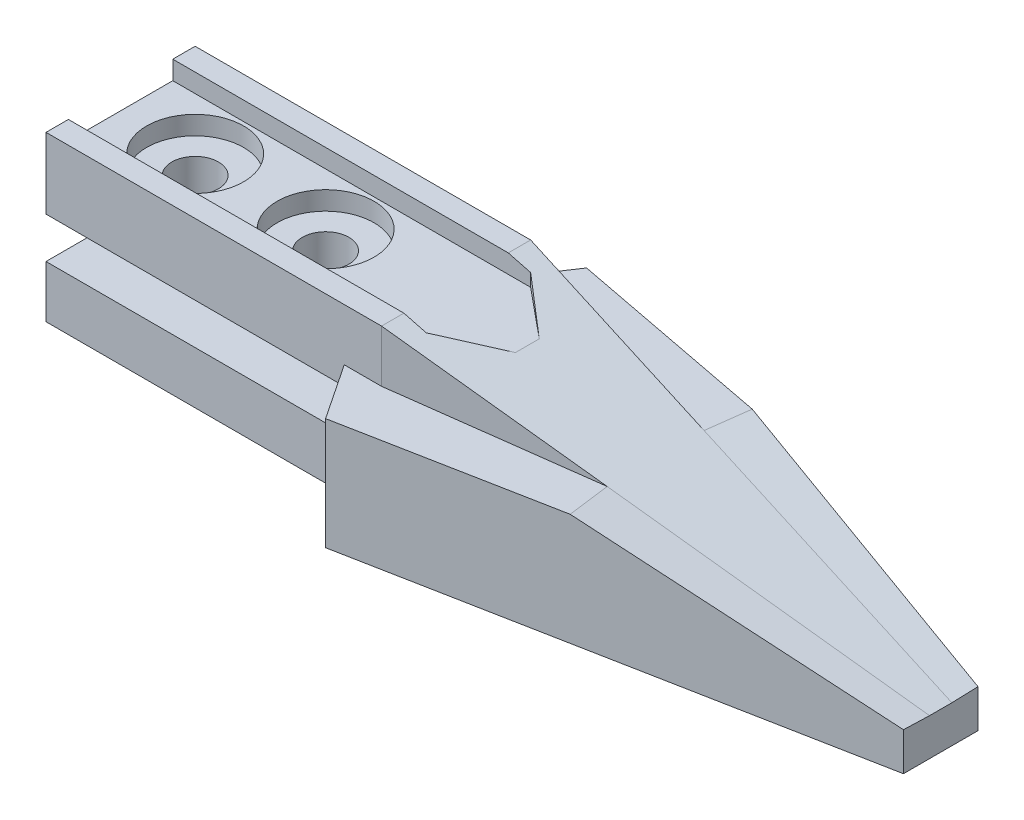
ISO-10303-21;
HEADER;
FILE_DESCRIPTION(('STEP AP214'),'2;1');
FILE_NAME('part.step','',(''),(''),'','','');
FILE_SCHEMA(('AUTOMOTIVE_DESIGN { 1 0 10303 214 1 1 1 1 }'));
ENDSEC;
DATA;
#1=APPLICATION_CONTEXT('core data for automotive mechanical design processes');
#2=APPLICATION_PROTOCOL_DEFINITION('international standard','automotive_design',2000,#1);
#3=PRODUCT_CONTEXT('',#1,'mechanical');
#4=PRODUCT('Part','Part','',(#3));
#5=PRODUCT_RELATED_PRODUCT_CATEGORY('part','',(#4));
#6=PRODUCT_DEFINITION_FORMATION('','',#4);
#7=PRODUCT_DEFINITION_CONTEXT('part definition',#1,'design');
#8=PRODUCT_DEFINITION('design','',#6,#7);
#9=PRODUCT_DEFINITION_SHAPE('','',#8);
#10=(LENGTH_UNIT() NAMED_UNIT(*) SI_UNIT(.MILLI.,.METRE.));
#11=(NAMED_UNIT(*) PLANE_ANGLE_UNIT() SI_UNIT($,.RADIAN.));
#12=(NAMED_UNIT(*) SI_UNIT($,.STERADIAN.) SOLID_ANGLE_UNIT());
#13=UNCERTAINTY_MEASURE_WITH_UNIT(LENGTH_MEASURE(1.E-05),#10,'distance_accuracy_value','');
#14=(GEOMETRIC_REPRESENTATION_CONTEXT(3) GLOBAL_UNCERTAINTY_ASSIGNED_CONTEXT((#13)) GLOBAL_UNIT_ASSIGNED_CONTEXT((#10,
#11,#12)) REPRESENTATION_CONTEXT('',''));
#15=CARTESIAN_POINT('',(0.,0.,0.));
#16=DIRECTION('',(0.,0.,1.));
#17=DIRECTION('',(1.,0.,0.));
#18=AXIS2_PLACEMENT_3D('',#15,#16,#17);
#19=CARTESIAN_POINT('',(220.,-34.,20.));
#20=DIRECTION('',(-1.,0.,0.));
#21=DIRECTION('',(0.,0.,1.));
#22=AXIS2_PLACEMENT_3D('',#19,#20,#21);
#23=PLANE('',#22);
#24=DIRECTION('',(0.,-0.0336071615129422,-0.999435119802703));
#25=VECTOR('',#24,1.);
#26=CARTESIAN_POINT('',(220.,-33.4290009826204,19.9807994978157));
#27=LINE('',#26,#25);
#28=CARTESIAN_POINT('',(220.,-33.7646169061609,10.));
#29=VERTEX_POINT('',#28);
#30=CARTESIAN_POINT('',(220.,-34.,3.00000000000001));
#31=VERTEX_POINT('',#30);
#32=EDGE_CURVE('E192',#29,#31,#27,.T.);
#33=ORIENTED_EDGE('',*,*,#32,.F.);
#34=DIRECTION('',(0.,-1.,0.));
#35=VECTOR('',#34,1.);
#36=CARTESIAN_POINT('',(220.,-14.,10.));
#37=LINE('',#36,#35);
#38=CARTESIAN_POINT('',(220.,-44.,10.));
#39=VERTEX_POINT('',#38);
#40=EDGE_CURVE('E499',#29,#39,#37,.T.);
#41=ORIENTED_EDGE('',*,*,#40,.T.);
#42=DIRECTION('',(0.,0.,-1.));
#43=VECTOR('',#42,1.);
#44=CARTESIAN_POINT('',(220.,-44.,20.));
#45=LINE('',#44,#43);
#46=CARTESIAN_POINT('',(220.,-44.,-10.));
#47=VERTEX_POINT('',#46);
#48=EDGE_CURVE('E218',#39,#47,#45,.T.);
#49=ORIENTED_EDGE('',*,*,#48,.T.);
#50=DIRECTION('',(0.,-1.,0.));
#51=VECTOR('',#50,1.);
#52=CARTESIAN_POINT('',(220.,-14.,-10.));
#53=LINE('',#52,#51);
#54=CARTESIAN_POINT('',(220.,-33.7646169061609,-10.));
#55=VERTEX_POINT('',#54);
#56=EDGE_CURVE('E296',#55,#47,#53,.T.);
#57=ORIENTED_EDGE('',*,*,#56,.F.);
#58=DIRECTION('',(0.,-0.0336071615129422,0.999435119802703));
#59=VECTOR('',#58,1.);
#60=CARTESIAN_POINT('',(220.,-34.772528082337,19.974022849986));
#61=LINE('',#60,#59);
#62=CARTESIAN_POINT('',(220.,-34.,-3.00000000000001));
#63=VERTEX_POINT('',#62);
#64=EDGE_CURVE('E217',#55,#63,#61,.T.);
#65=ORIENTED_EDGE('',*,*,#64,.T.);
#66=DIRECTION('',(0.,0.,-1.));
#67=VECTOR('',#66,1.);
#68=CARTESIAN_POINT('',(220.,-34.,20.));
#69=LINE('',#68,#67);
#70=EDGE_CURVE('E210',#31,#63,#69,.T.);
#71=ORIENTED_EDGE('',*,*,#70,.F.);
#72=EDGE_LOOP('',(#33,#41,#49,#57,#65,#71));
#73=FACE_BOUND('',#72,.T.);
#74=ADVANCED_FACE('F39',(#73),#23,.F.);
#75=CARTESIAN_POINT('',(90.,-14.,35.));
#76=DIRECTION('',(-0.188847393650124,0.,-0.982006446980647));
#77=DIRECTION('',(-0.982006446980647,0.,0.188847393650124));
#78=AXIS2_PLACEMENT_3D('',#75,#76,#77);
#79=PLANE('',#78);
#80=DIRECTION('',(0.950670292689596,-0.250604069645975,-0.182821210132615));
#81=VECTOR('',#80,1.);
#82=CARTESIAN_POINT('',(93.4555531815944,-0.406518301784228,34.3354705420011));
#83=LINE('',#82,#81);
#84=CARTESIAN_POINT('',(145.022629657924,-14.,24.4187250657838));
#85=VERTEX_POINT('',#84);
#86=EDGE_CURVE('E198',#85,#29,#83,.T.);
#87=ORIENTED_EDGE('',*,*,#86,.F.);
#88=DIRECTION('',(0.982006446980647,0.,-0.188847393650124));
#89=VECTOR('',#88,1.);
#90=CARTESIAN_POINT('',(90.,-14.,35.));
#91=LINE('',#90,#89);
#92=CARTESIAN_POINT('',(90.,-14.,35.));
#93=VERTEX_POINT('',#92);
#94=EDGE_CURVE('E292',#93,#85,#91,.T.);
#95=ORIENTED_EDGE('',*,*,#94,.F.);
#96=DIRECTION('',(0.,-1.,0.));
#97=VECTOR('',#96,1.);
#98=CARTESIAN_POINT('',(90.,-14.,35.));
#99=LINE('',#98,#97);
#100=CARTESIAN_POINT('',(90.,-44.,35.));
#101=VERTEX_POINT('',#100);
#102=EDGE_CURVE('E502',#93,#101,#99,.T.);
#103=ORIENTED_EDGE('',*,*,#102,.T.);
#104=DIRECTION('',(0.982006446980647,0.,-0.188847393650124));
#105=VECTOR('',#104,1.);
#106=CARTESIAN_POINT('',(90.,-44.,35.));
#107=LINE('',#106,#105);
#108=EDGE_CURVE('E202',#101,#39,#107,.T.);
#109=ORIENTED_EDGE('',*,*,#108,.T.);
#110=ORIENTED_EDGE('',*,*,#40,.F.);
#111=EDGE_LOOP('',(#87,#95,#103,#109,#110));
#112=FACE_BOUND('',#111,.T.);
#113=ADVANCED_FACE('F498',(#112),#79,.F.);
#114=CARTESIAN_POINT('',(220.,-14.,20.));
#115=DIRECTION('',(0.,-1.,0.));
#116=DIRECTION('',(1.,0.,0.));
#117=AXIS2_PLACEMENT_3D('',#114,#115,#116);
#118=PLANE('',#117);
#119=DIRECTION('',(0.129665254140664,0.,0.991557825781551));
#120=VECTOR('',#119,1.);
#121=CARTESIAN_POINT('',(145.715111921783,-14.,29.7141776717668));
#122=LINE('',#121,#120);
#123=CARTESIAN_POINT('',(143.529411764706,-14.,13.));
#124=VERTEX_POINT('',#123);
#125=EDGE_CURVE('E11',#124,#85,#122,.T.);
#126=ORIENTED_EDGE('',*,*,#125,.F.);
#127=DIRECTION('',(-0.991557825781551,0.,0.129665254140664));
#128=VECTOR('',#127,1.);
#129=CARTESIAN_POINT('',(220.,-14.,3.));
#130=LINE('',#129,#128);
#131=CARTESIAN_POINT('',(90.,-14.,20.));
#132=VERTEX_POINT('',#131);
#133=EDGE_CURVE('E47',#124,#132,#130,.T.);
#134=ORIENTED_EDGE('',*,*,#133,.T.);
#135=DIRECTION('',(-1.,0.,0.));
#136=VECTOR('',#135,1.);
#137=CARTESIAN_POINT('',(80.,-14.,20.));
#138=LINE('',#137,#136);
#139=CARTESIAN_POINT('',(80.,-14.,20.));
#140=VERTEX_POINT('',#139);
#141=EDGE_CURVE('E283',#132,#140,#138,.T.);
#142=ORIENTED_EDGE('',*,*,#141,.T.);
#143=DIRECTION('',(0.554700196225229,0.,0.832050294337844));
#144=VECTOR('',#143,1.);
#145=CARTESIAN_POINT('',(80.,-14.,20.));
#146=LINE('',#145,#144);
#147=EDGE_CURVE('E508',#140,#93,#146,.T.);
#148=ORIENTED_EDGE('',*,*,#147,.T.);
#149=ORIENTED_EDGE('',*,*,#94,.T.);
#150=EDGE_LOOP('',(#126,#134,#142,#148,#149));
#151=FACE_BOUND('',#150,.T.);
#152=ADVANCED_FACE('F282',(#151),#118,.F.);
#153=CARTESIAN_POINT('',(0.,0.,20.));
#154=DIRECTION('',(0.,0.,-1.));
#155=DIRECTION('',(-1.,0.,0.));
#156=AXIS2_PLACEMENT_3D('',#153,#154,#155);
#157=PLANE('',#156);
#158=DIRECTION('',(0.,-1.,0.));
#159=VECTOR('',#158,1.);
#160=CARTESIAN_POINT('',(80.,-14.,20.));
#161=LINE('',#160,#159);
#162=CARTESIAN_POINT('',(80.,-30.,20.));
#163=VERTEX_POINT('',#162);
#164=CARTESIAN_POINT('',(80.,-44.,20.));
#165=VERTEX_POINT('',#164);
#166=EDGE_CURVE('E511',#163,#165,#161,.T.);
#167=ORIENTED_EDGE('',*,*,#166,.F.);
#168=DIRECTION('',(-1.,0.,0.));
#169=VECTOR('',#168,1.);
#170=CARTESIAN_POINT('',(80.,-30.,20.));
#171=LINE('',#170,#169);
#172=CARTESIAN_POINT('',(0.,-30.,20.));
#173=VERTEX_POINT('',#172);
#174=EDGE_CURVE('E396',#163,#173,#171,.T.);
#175=ORIENTED_EDGE('',*,*,#174,.T.);
#176=DIRECTION('',(0.,-1.,0.));
#177=VECTOR('',#176,1.);
#178=CARTESIAN_POINT('',(0.,-44.,20.));
#179=LINE('',#178,#177);
#180=CARTESIAN_POINT('',(0.,-44.,20.));
#181=VERTEX_POINT('',#180);
#182=EDGE_CURVE('E398',#173,#181,#179,.T.);
#183=ORIENTED_EDGE('',*,*,#182,.T.);
#184=DIRECTION('',(1.,0.,0.));
#185=VECTOR('',#184,1.);
#186=CARTESIAN_POINT('',(220.,-44.,20.));
#187=LINE('',#186,#185);
#188=EDGE_CURVE('E400',#181,#165,#187,.T.);
#189=ORIENTED_EDGE('',*,*,#188,.T.);
#190=EDGE_LOOP('',(#167,#175,#183,#189));
#191=FACE_BOUND('',#190,.T.);
#192=ADVANCED_FACE('F519',(#191),#157,.F.);
#193=CARTESIAN_POINT('',(80.,-19.,20.));
#194=VERTEX_POINT('',#193);
#195=EDGE_CURVE('E291',#140,#194,#161,.T.);
#196=ORIENTED_EDGE('',*,*,#195,.F.);
#197=ORIENTED_EDGE('',*,*,#141,.F.);
#198=DIRECTION('',(0.,1.,0.));
#199=VECTOR('',#198,1.);
#200=CARTESIAN_POINT('',(90.,-44.,20.));
#201=LINE('',#200,#199);
#202=CARTESIAN_POINT('',(90.,0.,20.));
#203=VERTEX_POINT('',#202);
#204=EDGE_CURVE('E213',#132,#203,#201,.T.);
#205=ORIENTED_EDGE('',*,*,#204,.T.);
#206=DIRECTION('',(-1.,0.,0.));
#207=VECTOR('',#206,1.);
#208=CARTESIAN_POINT('',(0.,0.,20.));
#209=LINE('',#208,#207);
#210=CARTESIAN_POINT('',(0.,0.,20.));
#211=VERTEX_POINT('',#210);
#212=EDGE_CURVE('E403',#203,#211,#209,.T.);
#213=ORIENTED_EDGE('',*,*,#212,.T.);
#214=DIRECTION('',(0.,-1.,0.));
#215=VECTOR('',#214,1.);
#216=CARTESIAN_POINT('',(0.,-19.,20.));
#217=LINE('',#216,#215);
#218=CARTESIAN_POINT('',(0.,-19.,20.));
#219=VERTEX_POINT('',#218);
#220=EDGE_CURVE('E389',#211,#219,#217,.T.);
#221=ORIENTED_EDGE('',*,*,#220,.T.);
#222=DIRECTION('',(1.,0.,0.));
#223=VECTOR('',#222,1.);
#224=CARTESIAN_POINT('',(0.,-19.,20.));
#225=LINE('',#224,#223);
#226=EDGE_CURVE('E392',#219,#194,#225,.T.);
#227=ORIENTED_EDGE('',*,*,#226,.T.);
#228=EDGE_LOOP('',(#196,#197,#205,#213,#221,#227));
#229=FACE_BOUND('',#228,.T.);
#230=ADVANCED_FACE('F289',(#229),#157,.F.);
#231=CARTESIAN_POINT('',(220.,-44.,3.));
#232=DIRECTION('',(-0.129665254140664,0.,-0.991557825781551));
#233=DIRECTION('',(-0.991557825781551,0.,0.129665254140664));
#234=AXIS2_PLACEMENT_3D('',#231,#232,#233);
#235=PLANE('',#234);
#236=ORIENTED_EDGE('',*,*,#133,.F.);
#237=DIRECTION('',(0.959808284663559,-0.251026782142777,-0.125513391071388));
#238=VECTOR('',#237,1.);
#239=CARTESIAN_POINT('',(90.,0.,20.));
#240=LINE('',#239,#238);
#241=EDGE_CURVE('E212',#203,#124,#240,.T.);
#242=ORIENTED_EDGE('',*,*,#241,.F.);
#243=ORIENTED_EDGE('',*,*,#204,.F.);
#244=EDGE_LOOP('',(#236,#242,#243));
#245=FACE_BOUND('',#244,.T.);
#246=ADVANCED_FACE('F295',(#245),#235,.F.);
#247=CARTESIAN_POINT('',(0.,0.,-20.));
#248=DIRECTION('',(0.,0.,-1.));
#249=DIRECTION('',(-1.,0.,0.));
#250=AXIS2_PLACEMENT_3D('',#247,#248,#249);
#251=PLANE('',#250);
#252=DIRECTION('',(0.,-1.,0.));
#253=VECTOR('',#252,1.);
#254=CARTESIAN_POINT('',(80.,-14.,-20.));
#255=LINE('',#254,#253);
#256=CARTESIAN_POINT('',(80.,-30.,-20.));
#257=VERTEX_POINT('',#256);
#258=CARTESIAN_POINT('',(80.,-44.,-20.));
#259=VERTEX_POINT('',#258);
#260=EDGE_CURVE('E461',#257,#259,#255,.T.);
#261=ORIENTED_EDGE('',*,*,#260,.T.);
#262=DIRECTION('',(1.,0.,0.));
#263=VECTOR('',#262,1.);
#264=CARTESIAN_POINT('',(220.,-44.,-20.));
#265=LINE('',#264,#263);
#266=CARTESIAN_POINT('',(0.,-44.,-20.));
#267=VERTEX_POINT('',#266);
#268=EDGE_CURVE('E383',#267,#259,#265,.T.);
#269=ORIENTED_EDGE('',*,*,#268,.F.);
#270=DIRECTION('',(0.,-1.,0.));
#271=VECTOR('',#270,1.);
#272=CARTESIAN_POINT('',(0.,-44.,-20.));
#273=LINE('',#272,#271);
#274=CARTESIAN_POINT('',(0.,-30.,-20.));
#275=VERTEX_POINT('',#274);
#276=EDGE_CURVE('E381',#275,#267,#273,.T.);
#277=ORIENTED_EDGE('',*,*,#276,.F.);
#278=DIRECTION('',(-1.,0.,0.));
#279=VECTOR('',#278,1.);
#280=CARTESIAN_POINT('',(80.,-30.,-20.));
#281=LINE('',#280,#279);
#282=EDGE_CURVE('E379',#257,#275,#281,.T.);
#283=ORIENTED_EDGE('',*,*,#282,.F.);
#284=EDGE_LOOP('',(#261,#269,#277,#283));
#285=FACE_BOUND('',#284,.T.);
#286=ADVANCED_FACE('F468',(#285),#251,.T.);
#287=CARTESIAN_POINT('',(90.,-44.,-20.));
#288=DIRECTION('',(-0.129665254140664,0.,0.991557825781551));
#289=DIRECTION('',(0.991557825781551,0.,0.129665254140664));
#290=AXIS2_PLACEMENT_3D('',#287,#288,#289);
#291=PLANE('',#290);
#292=DIRECTION('',(0.991557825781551,0.,0.129665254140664));
#293=VECTOR('',#292,1.);
#294=CARTESIAN_POINT('',(90.,-14.0000000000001,-20.));
#295=LINE('',#294,#293);
#296=CARTESIAN_POINT('',(90.,-14.,-20.));
#297=VERTEX_POINT('',#296);
#298=CARTESIAN_POINT('',(143.529411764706,-14.,-13.));
#299=VERTEX_POINT('',#298);
#300=EDGE_CURVE('E254',#297,#299,#295,.T.);
#301=ORIENTED_EDGE('',*,*,#300,.F.);
#302=DIRECTION('',(0.,1.,0.));
#303=VECTOR('',#302,1.);
#304=CARTESIAN_POINT('',(90.,-44.,-20.));
#305=LINE('',#304,#303);
#306=CARTESIAN_POINT('',(90.,0.,-20.));
#307=VERTEX_POINT('',#306);
#308=EDGE_CURVE('E304',#297,#307,#305,.T.);
#309=ORIENTED_EDGE('',*,*,#308,.T.);
#310=DIRECTION('',(-0.959808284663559,0.251026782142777,-0.125513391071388));
#311=VECTOR('',#310,1.);
#312=CARTESIAN_POINT('',(94.8187517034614,-1.26028890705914,-19.3698555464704));
#313=LINE('',#312,#311);
#314=EDGE_CURVE('E307',#299,#307,#313,.T.);
#315=ORIENTED_EDGE('',*,*,#314,.F.);
#316=EDGE_LOOP('',(#301,#309,#315));
#317=FACE_BOUND('',#316,.T.);
#318=ADVANCED_FACE('F445',(#317),#291,.F.);
#319=CARTESIAN_POINT('',(55.,-44.,0.));
#320=DIRECTION('',(0.,1.,0.));
#321=DIRECTION('',(0.,0.,1.));
#322=AXIS2_PLACEMENT_3D('',#319,#320,#321);
#323=CYLINDRICAL_SURFACE('',#322,6.25);
#324=CARTESIAN_POINT('',(55.,-30.,0.));
#325=DIRECTION('',(0.,-1.,0.));
#326=DIRECTION('',(1.,0.,0.));
#327=AXIS2_PLACEMENT_3D('',#324,#325,#326);
#328=CIRCLE('',#327,6.25);
#329=CARTESIAN_POINT('',(61.25,-30.,0.));
#330=VERTEX_POINT('',#329);
#331=EDGE_CURVE('E258',#330,#330,#328,.T.);
#332=ORIENTED_EDGE('',*,*,#331,.F.);
#333=EDGE_LOOP('',(#332));
#334=FACE_BOUND('',#333,.T.);
#335=CARTESIAN_POINT('',(55.,-39.,0.));
#336=DIRECTION('',(0.,-1.,0.));
#337=DIRECTION('',(1.,0.,0.));
#338=AXIS2_PLACEMENT_3D('',#335,#336,#337);
#339=CIRCLE('',#338,6.25);
#340=CARTESIAN_POINT('',(61.25,-39.,0.));
#341=VERTEX_POINT('',#340);
#342=EDGE_CURVE('E270',#341,#341,#339,.F.);
#343=ORIENTED_EDGE('',*,*,#342,.F.);
#344=EDGE_LOOP('',(#343));
#345=FACE_BOUND('',#344,.T.);
#346=ADVANCED_FACE('F589',(#334,#345),#323,.F.);
#347=CARTESIAN_POINT('',(20.,-44.,0.));
#348=DIRECTION('',(0.,1.,0.));
#349=DIRECTION('',(0.,0.,1.));
#350=AXIS2_PLACEMENT_3D('',#347,#348,#349);
#351=CYLINDRICAL_SURFACE('',#350,6.25);
#352=CARTESIAN_POINT('',(20.,-30.,0.));
#353=DIRECTION('',(0.,-1.,0.));
#354=DIRECTION('',(1.,0.,0.));
#355=AXIS2_PLACEMENT_3D('',#352,#353,#354);
#356=CIRCLE('',#355,6.25);
#357=CARTESIAN_POINT('',(26.25,-30.,0.));
#358=VERTEX_POINT('',#357);
#359=EDGE_CURVE('E332',#358,#358,#356,.T.);
#360=ORIENTED_EDGE('',*,*,#359,.F.);
#361=EDGE_LOOP('',(#360));
#362=FACE_BOUND('',#361,.T.);
#363=CARTESIAN_POINT('',(20.,-39.,0.));
#364=DIRECTION('',(0.,-1.,0.));
#365=DIRECTION('',(1.,0.,0.));
#366=AXIS2_PLACEMENT_3D('',#363,#364,#365);
#367=CIRCLE('',#366,6.25);
#368=CARTESIAN_POINT('',(26.25,-39.,0.));
#369=VERTEX_POINT('',#368);
#370=EDGE_CURVE('E265',#369,#369,#367,.F.);
#371=ORIENTED_EDGE('',*,*,#370,.F.);
#372=EDGE_LOOP('',(#371));
#373=FACE_BOUND('',#372,.T.);
#374=ADVANCED_FACE('F560',(#362,#373),#351,.F.);
#375=CARTESIAN_POINT('',(20.,-19.,0.));
#376=DIRECTION('',(0.,1.,0.));
#377=DIRECTION('',(0.,0.,1.));
#378=AXIS2_PLACEMENT_3D('',#375,#376,#377);
#379=CIRCLE('',#378,6.25);
#380=CARTESIAN_POINT('',(20.,-19.,6.25));
#381=VERTEX_POINT('',#380);
#382=EDGE_CURVE('E335',#381,#381,#379,.T.);
#383=ORIENTED_EDGE('',*,*,#382,.F.);
#384=EDGE_LOOP('',(#383));
#385=FACE_BOUND('',#384,.T.);
#386=CARTESIAN_POINT('',(20.,-10.,0.));
#387=DIRECTION('',(0.,1.,0.));
#388=DIRECTION('',(0.,0.,1.));
#389=AXIS2_PLACEMENT_3D('',#386,#387,#388);
#390=CIRCLE('',#389,6.25);
#391=CARTESIAN_POINT('',(20.,-10.,6.25));
#392=VERTEX_POINT('',#391);
#393=EDGE_CURVE('E260',#392,#392,#390,.F.);
#394=ORIENTED_EDGE('',*,*,#393,.F.);
#395=EDGE_LOOP('',(#394));
#396=FACE_BOUND('',#395,.T.);
#397=ADVANCED_FACE('F556',(#385,#396),#351,.F.);
#398=CARTESIAN_POINT('',(55.,-19.,0.));
#399=DIRECTION('',(0.,1.,0.));
#400=DIRECTION('',(0.,0.,1.));
#401=AXIS2_PLACEMENT_3D('',#398,#399,#400);
#402=CIRCLE('',#401,6.25);
#403=CARTESIAN_POINT('',(55.,-19.,6.24999999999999));
#404=VERTEX_POINT('',#403);
#405=EDGE_CURVE('E329',#404,#404,#402,.T.);
#406=ORIENTED_EDGE('',*,*,#405,.F.);
#407=EDGE_LOOP('',(#406));
#408=FACE_BOUND('',#407,.T.);
#409=CARTESIAN_POINT('',(55.,-10.,0.));
#410=DIRECTION('',(0.,1.,0.));
#411=DIRECTION('',(0.,0.,1.));
#412=AXIS2_PLACEMENT_3D('',#409,#410,#411);
#413=CIRCLE('',#412,6.25);
#414=CARTESIAN_POINT('',(55.,-10.,6.24999999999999));
#415=VERTEX_POINT('',#414);
#416=EDGE_CURVE('E255',#415,#415,#413,.F.);
#417=ORIENTED_EDGE('',*,*,#416,.F.);
#418=EDGE_LOOP('',(#417));
#419=FACE_BOUND('',#418,.T.);
#420=ADVANCED_FACE('F559',(#408,#419),#323,.F.);
#421=CARTESIAN_POINT('',(0.,0.,20.));
#422=DIRECTION('',(0.,-1.,0.));
#423=DIRECTION('',(0.,0.,-1.));
#424=AXIS2_PLACEMENT_3D('',#421,#422,#423);
#425=PLANE('',#424);
#426=DIRECTION('',(0.,0.,-1.));
#427=VECTOR('',#426,1.);
#428=CARTESIAN_POINT('',(0.,0.,20.));
#429=LINE('',#428,#427);
#430=CARTESIAN_POINT('',(0.,0.,-14.));
#431=VERTEX_POINT('',#430);
#432=CARTESIAN_POINT('',(0.,0.,-20.));
#433=VERTEX_POINT('',#432);
#434=EDGE_CURVE('E404',#431,#433,#429,.T.);
#435=ORIENTED_EDGE('',*,*,#434,.F.);
#436=DIRECTION('',(1.,0.,0.));
#437=VECTOR('',#436,1.);
#438=CARTESIAN_POINT('',(0.,0.,-14.));
#439=LINE('',#438,#437);
#440=CARTESIAN_POINT('',(90.,0.,-14.));
#441=VERTEX_POINT('',#440);
#442=EDGE_CURVE('E243',#431,#441,#439,.T.);
#443=ORIENTED_EDGE('',*,*,#442,.T.);
#444=DIRECTION('',(0.,0.,-1.));
#445=VECTOR('',#444,1.);
#446=CARTESIAN_POINT('',(90.,0.,20.));
#447=LINE('',#446,#445);
#448=EDGE_CURVE('E225',#441,#307,#447,.T.);
#449=ORIENTED_EDGE('',*,*,#448,.T.);
#450=DIRECTION('',(-1.,0.,0.));
#451=VECTOR('',#450,1.);
#452=CARTESIAN_POINT('',(0.,0.,-20.));
#453=LINE('',#452,#451);
#454=EDGE_CURVE('E386',#307,#433,#453,.T.);
#455=ORIENTED_EDGE('',*,*,#454,.T.);
#456=EDGE_LOOP('',(#435,#443,#449,#455));
#457=FACE_BOUND('',#456,.T.);
#458=ADVANCED_FACE('F417',(#457),#425,.F.);
#459=CARTESIAN_POINT('',(0.,-19.,20.));
#460=DIRECTION('',(1.,0.,0.));
#461=DIRECTION('',(0.,0.,-1.));
#462=AXIS2_PLACEMENT_3D('',#459,#460,#461);
#463=PLANE('',#462);
#464=DIRECTION('',(0.,0.,1.));
#465=VECTOR('',#464,1.);
#466=CARTESIAN_POINT('',(0.,-5.,-14.));
#467=LINE('',#466,#465);
#468=CARTESIAN_POINT('',(0.,-5.,-14.));
#469=VERTEX_POINT('',#468);
#470=CARTESIAN_POINT('',(0.,-5.,14.));
#471=VERTEX_POINT('',#470);
#472=EDGE_CURVE('E340',#469,#471,#467,.T.);
#473=ORIENTED_EDGE('',*,*,#472,.F.);
#474=DIRECTION('',(0.,1.,0.));
#475=VECTOR('',#474,1.);
#476=CARTESIAN_POINT('',(0.,-5.,-14.));
#477=LINE('',#476,#475);
#478=EDGE_CURVE('E354',#469,#431,#477,.T.);
#479=ORIENTED_EDGE('',*,*,#478,.T.);
#480=ORIENTED_EDGE('',*,*,#434,.T.);
#481=DIRECTION('',(0.,-1.,0.));
#482=VECTOR('',#481,1.);
#483=CARTESIAN_POINT('',(0.,-19.,-20.));
#484=LINE('',#483,#482);
#485=CARTESIAN_POINT('',(0.,-19.,-20.));
#486=VERTEX_POINT('',#485);
#487=EDGE_CURVE('E370',#433,#486,#484,.T.);
#488=ORIENTED_EDGE('',*,*,#487,.T.);
#489=DIRECTION('',(0.,0.,-1.));
#490=VECTOR('',#489,1.);
#491=CARTESIAN_POINT('',(0.,-19.,20.));
#492=LINE('',#491,#490);
#493=EDGE_CURVE('E240',#219,#486,#492,.T.);
#494=ORIENTED_EDGE('',*,*,#493,.F.);
#495=ORIENTED_EDGE('',*,*,#220,.F.);
#496=CARTESIAN_POINT('',(0.,0.,14.));
#497=VERTEX_POINT('',#496);
#498=EDGE_CURVE('E405',#211,#497,#429,.T.);
#499=ORIENTED_EDGE('',*,*,#498,.T.);
#500=DIRECTION('',(0.,1.,0.));
#501=VECTOR('',#500,1.);
#502=CARTESIAN_POINT('',(0.,-5.,14.));
#503=LINE('',#502,#501);
#504=EDGE_CURVE('E62',#471,#497,#503,.T.);
#505=ORIENTED_EDGE('',*,*,#504,.F.);
#506=EDGE_LOOP('',(#473,#479,#480,#488,#494,#495,#499,#505));
#507=FACE_BOUND('',#506,.T.);
#508=ADVANCED_FACE('F41',(#507),#463,.F.);
#509=CARTESIAN_POINT('',(0.,-19.,20.));
#510=DIRECTION('',(0.,1.,0.));
#511=DIRECTION('',(0.,0.,1.));
#512=AXIS2_PLACEMENT_3D('',#509,#510,#511);
#513=PLANE('',#512);
#514=ORIENTED_EDGE('',*,*,#405,.T.);
#515=EDGE_LOOP('',(#514));
#516=FACE_BOUND('',#515,.T.);
#517=ORIENTED_EDGE('',*,*,#382,.T.);
#518=EDGE_LOOP('',(#517));
#519=FACE_BOUND('',#518,.T.);
#520=DIRECTION('',(1.,0.,0.));
#521=VECTOR('',#520,1.);
#522=CARTESIAN_POINT('',(0.,-19.,-20.));
#523=LINE('',#522,#521);
#524=CARTESIAN_POINT('',(80.,-19.,-20.));
#525=VERTEX_POINT('',#524);
#526=EDGE_CURVE('E373',#486,#525,#523,.T.);
#527=ORIENTED_EDGE('',*,*,#526,.T.);
#528=DIRECTION('',(0.,0.,-1.));
#529=VECTOR('',#528,1.);
#530=CARTESIAN_POINT('',(80.,-19.,20.));
#531=LINE('',#530,#529);
#532=EDGE_CURVE('E237',#194,#525,#531,.T.);
#533=ORIENTED_EDGE('',*,*,#532,.F.);
#534=ORIENTED_EDGE('',*,*,#226,.F.);
#535=ORIENTED_EDGE('',*,*,#493,.T.);
#536=EDGE_LOOP('',(#527,#533,#534,#535));
#537=FACE_BOUND('',#536,.T.);
#538=ADVANCED_FACE('F426',(#516,#519,#537),#513,.F.);
#539=CARTESIAN_POINT('',(80.,-19.,20.));
#540=DIRECTION('',(1.,0.,0.));
#541=DIRECTION('',(0.,0.,-1.));
#542=AXIS2_PLACEMENT_3D('',#539,#540,#541);
#543=PLANE('',#542);
#544=DIRECTION('',(0.,-1.,0.));
#545=VECTOR('',#544,1.);
#546=CARTESIAN_POINT('',(80.,-19.,-20.));
#547=LINE('',#546,#545);
#548=EDGE_CURVE('E376',#525,#257,#547,.T.);
#549=ORIENTED_EDGE('',*,*,#548,.T.);
#550=DIRECTION('',(0.,0.,-1.));
#551=VECTOR('',#550,1.);
#552=CARTESIAN_POINT('',(80.,-30.,20.));
#553=LINE('',#552,#551);
#554=EDGE_CURVE('E234',#163,#257,#553,.T.);
#555=ORIENTED_EDGE('',*,*,#554,.F.);
#556=DIRECTION('',(0.,-1.,0.));
#557=VECTOR('',#556,1.);
#558=CARTESIAN_POINT('',(80.,-19.,20.));
#559=LINE('',#558,#557);
#560=EDGE_CURVE('E394',#194,#163,#559,.T.);
#561=ORIENTED_EDGE('',*,*,#560,.F.);
#562=ORIENTED_EDGE('',*,*,#532,.T.);
#563=EDGE_LOOP('',(#549,#555,#561,#562));
#564=FACE_BOUND('',#563,.T.);
#565=ADVANCED_FACE('F487',(#564),#543,.F.);
#566=CARTESIAN_POINT('',(80.,-30.,20.));
#567=DIRECTION('',(0.,-1.,0.));
#568=DIRECTION('',(1.,0.,0.));
#569=AXIS2_PLACEMENT_3D('',#566,#567,#568);
#570=PLANE('',#569);
#571=ORIENTED_EDGE('',*,*,#331,.T.);
#572=EDGE_LOOP('',(#571));
#573=FACE_BOUND('',#572,.T.);
#574=ORIENTED_EDGE('',*,*,#359,.T.);
#575=EDGE_LOOP('',(#574));
#576=FACE_BOUND('',#575,.T.);
#577=ORIENTED_EDGE('',*,*,#282,.T.);
#578=DIRECTION('',(0.,0.,-1.));
#579=VECTOR('',#578,1.);
#580=CARTESIAN_POINT('',(0.,-30.,20.));
#581=LINE('',#580,#579);
#582=EDGE_CURVE('E231',#173,#275,#581,.T.);
#583=ORIENTED_EDGE('',*,*,#582,.F.);
#584=ORIENTED_EDGE('',*,*,#174,.F.);
#585=ORIENTED_EDGE('',*,*,#554,.T.);
#586=EDGE_LOOP('',(#577,#583,#584,#585));
#587=FACE_BOUND('',#586,.T.);
#588=ADVANCED_FACE('F483',(#573,#576,#587),#570,.F.);
#589=CARTESIAN_POINT('',(0.,-44.,20.));
#590=DIRECTION('',(1.,0.,0.));
#591=DIRECTION('',(0.,0.,-1.));
#592=AXIS2_PLACEMENT_3D('',#589,#590,#591);
#593=PLANE('',#592);
#594=ORIENTED_EDGE('',*,*,#276,.T.);
#595=DIRECTION('',(0.,0.,-1.));
#596=VECTOR('',#595,1.);
#597=CARTESIAN_POINT('',(0.,-44.,20.));
#598=LINE('',#597,#596);
#599=EDGE_CURVE('E222',#181,#267,#598,.T.);
#600=ORIENTED_EDGE('',*,*,#599,.F.);
#601=ORIENTED_EDGE('',*,*,#182,.F.);
#602=ORIENTED_EDGE('',*,*,#582,.T.);
#603=EDGE_LOOP('',(#594,#600,#601,#602));
#604=FACE_BOUND('',#603,.T.);
#605=ADVANCED_FACE('F479',(#604),#593,.F.);
#606=CARTESIAN_POINT('',(220.,-44.,20.));
#607=DIRECTION('',(0.,1.,0.));
#608=DIRECTION('',(-1.,0.,0.));
#609=AXIS2_PLACEMENT_3D('',#606,#607,#608);
#610=PLANE('',#609);
#611=DIRECTION('',(0.554700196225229,0.,0.832050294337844));
#612=VECTOR('',#611,1.);
#613=CARTESIAN_POINT('',(80.,-44.,20.));
#614=LINE('',#613,#612);
#615=EDGE_CURVE('E293',#165,#101,#614,.T.);
#616=ORIENTED_EDGE('',*,*,#615,.F.);
#617=ORIENTED_EDGE('',*,*,#188,.F.);
#618=ORIENTED_EDGE('',*,*,#599,.T.);
#619=ORIENTED_EDGE('',*,*,#268,.T.);
#620=DIRECTION('',(0.554700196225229,0.,-0.832050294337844));
#621=VECTOR('',#620,1.);
#622=CARTESIAN_POINT('',(80.,-44.,-20.));
#623=LINE('',#622,#621);
#624=CARTESIAN_POINT('',(90.,-44.,-35.));
#625=VERTEX_POINT('',#624);
#626=EDGE_CURVE('E456',#259,#625,#623,.T.);
#627=ORIENTED_EDGE('',*,*,#626,.T.);
#628=DIRECTION('',(0.982006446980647,0.,0.188847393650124));
#629=VECTOR('',#628,1.);
#630=CARTESIAN_POINT('',(90.,-44.,-35.));
#631=LINE('',#630,#629);
#632=EDGE_CURVE('E450',#625,#47,#631,.T.);
#633=ORIENTED_EDGE('',*,*,#632,.T.);
#634=ORIENTED_EDGE('',*,*,#48,.F.);
#635=ORIENTED_EDGE('',*,*,#108,.F.);
#636=EDGE_LOOP('',(#616,#617,#618,#619,#627,#633,#634,#635));
#637=FACE_BOUND('',#636,.T.);
#638=CARTESIAN_POINT('',(55.,-44.,0.));
#639=DIRECTION('',(0.,-1.,0.));
#640=DIRECTION('',(1.,0.,0.));
#641=AXIS2_PLACEMENT_3D('',#638,#639,#640);
#642=CIRCLE('',#641,13.);
#643=CARTESIAN_POINT('',(68.,-44.,0.));
#644=VERTEX_POINT('',#643);
#645=EDGE_CURVE('E310',#644,#644,#642,.T.);
#646=ORIENTED_EDGE('',*,*,#645,.F.);
#647=EDGE_LOOP('',(#646));
#648=FACE_BOUND('',#647,.T.);
#649=CARTESIAN_POINT('',(20.,-44.,0.));
#650=DIRECTION('',(0.,-1.,0.));
#651=DIRECTION('',(1.,0.,0.));
#652=AXIS2_PLACEMENT_3D('',#649,#650,#651);
#653=CIRCLE('',#652,13.);
#654=CARTESIAN_POINT('',(33.,-44.,0.));
#655=VERTEX_POINT('',#654);
#656=EDGE_CURVE('E273',#655,#655,#653,.T.);
#657=ORIENTED_EDGE('',*,*,#656,.F.);
#658=EDGE_LOOP('',(#657));
#659=FACE_BOUND('',#658,.T.);
#660=ADVANCED_FACE('F473',(#637,#648,#659),#610,.F.);
#661=CARTESIAN_POINT('',(90.,0.,20.));
#662=DIRECTION('',(-0.253027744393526,-0.967459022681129,0.));
#663=DIRECTION('',(0.967459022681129,-0.253027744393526,0.));
#664=AXIS2_PLACEMENT_3D('',#661,#662,#663);
#665=PLANE('',#664);
#666=CARTESIAN_POINT('',(90.,0.,14.));
#667=VERTEX_POINT('',#666);
#668=EDGE_CURVE('E219',#203,#667,#447,.T.);
#669=ORIENTED_EDGE('',*,*,#668,.F.);
#670=ORIENTED_EDGE('',*,*,#241,.T.);
#671=EDGE_CURVE('E195',#124,#31,#240,.T.);
#672=ORIENTED_EDGE('',*,*,#671,.T.);
#673=ORIENTED_EDGE('',*,*,#70,.T.);
#674=EDGE_CURVE('E308',#63,#299,#313,.T.);
#675=ORIENTED_EDGE('',*,*,#674,.T.);
#676=ORIENTED_EDGE('',*,*,#314,.T.);
#677=ORIENTED_EDGE('',*,*,#448,.F.);
#678=DIRECTION('',(0.967459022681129,-0.253027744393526,0.));
#679=VECTOR('',#678,1.);
#680=CARTESIAN_POINT('',(90.,0.,-14.));
#681=LINE('',#680,#679);
#682=CARTESIAN_POINT('',(96.,-1.56923076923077,-14.));
#683=VERTEX_POINT('',#682);
#684=EDGE_CURVE('E367',#441,#683,#681,.T.);
#685=ORIENTED_EDGE('',*,*,#684,.T.);
#686=DIRECTION('',(0.75666368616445,-0.197896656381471,0.623134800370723));
#687=VECTOR('',#686,1.);
#688=CARTESIAN_POINT('',(108.360900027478,-4.80208154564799,-3.82043527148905));
#689=LINE('',#688,#687);
#690=CARTESIAN_POINT('',(109.117647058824,-5.,-3.19723183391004));
#691=VERTEX_POINT('',#690);
#692=EDGE_CURVE('E251',#683,#691,#689,.T.);
#693=ORIENTED_EDGE('',*,*,#692,.T.);
#694=DIRECTION('',(0.,0.,-1.));
#695=VECTOR('',#694,1.);
#696=CARTESIAN_POINT('',(109.117647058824,-5.,20.));
#697=LINE('',#696,#695);
#698=CARTESIAN_POINT('',(109.117647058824,-5.,3.19723183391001));
#699=VERTEX_POINT('',#698);
#700=EDGE_CURVE('E246',#699,#691,#697,.T.);
#701=ORIENTED_EDGE('',*,*,#700,.F.);
#702=DIRECTION('',(-0.75666368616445,0.197896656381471,0.623134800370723));
#703=VECTOR('',#702,1.);
#704=CARTESIAN_POINT('',(89.5007610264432,0.130570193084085,19.3523144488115));
#705=LINE('',#704,#703);
#706=CARTESIAN_POINT('',(96.,-1.56923076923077,14.));
#707=VERTEX_POINT('',#706);
#708=EDGE_CURVE('E248',#699,#707,#705,.T.);
#709=ORIENTED_EDGE('',*,*,#708,.T.);
#710=DIRECTION('',(-0.967459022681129,0.253027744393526,0.));
#711=VECTOR('',#710,1.);
#712=CARTESIAN_POINT('',(90.,0.,14.));
#713=LINE('',#712,#711);
#714=EDGE_CURVE('E357',#707,#667,#713,.T.);
#715=ORIENTED_EDGE('',*,*,#714,.T.);
#716=EDGE_LOOP('',(#669,#670,#672,#673,#675,#676,#677,#685,#693,#701,#709,#715));
#717=FACE_BOUND('',#716,.T.);
#718=ADVANCED_FACE('F208',(#717),#665,.F.);
#719=ORIENTED_EDGE('',*,*,#668,.T.);
#720=DIRECTION('',(1.,0.,0.));
#721=VECTOR('',#720,1.);
#722=CARTESIAN_POINT('',(0.,0.,14.));
#723=LINE('',#722,#721);
#724=EDGE_CURVE('E338',#497,#667,#723,.T.);
#725=ORIENTED_EDGE('',*,*,#724,.F.);
#726=ORIENTED_EDGE('',*,*,#498,.F.);
#727=ORIENTED_EDGE('',*,*,#212,.F.);
#728=EDGE_LOOP('',(#719,#725,#726,#727));
#729=FACE_BOUND('',#728,.T.);
#730=ADVANCED_FACE('F429',(#729),#425,.F.);
#731=CARTESIAN_POINT('',(80.,-14.,-20.));
#732=VERTEX_POINT('',#731);
#733=EDGE_CURVE('E301',#732,#525,#255,.T.);
#734=ORIENTED_EDGE('',*,*,#733,.T.);
#735=ORIENTED_EDGE('',*,*,#526,.F.);
#736=ORIENTED_EDGE('',*,*,#487,.F.);
#737=ORIENTED_EDGE('',*,*,#454,.F.);
#738=ORIENTED_EDGE('',*,*,#308,.F.);
#739=DIRECTION('',(-1.,0.,0.));
#740=VECTOR('',#739,1.);
#741=CARTESIAN_POINT('',(80.,-14.,-20.));
#742=LINE('',#741,#740);
#743=EDGE_CURVE('E446',#297,#732,#742,.T.);
#744=ORIENTED_EDGE('',*,*,#743,.T.);
#745=EDGE_LOOP('',(#734,#735,#736,#737,#738,#744));
#746=FACE_BOUND('',#745,.T.);
#747=ADVANCED_FACE('F422',(#746),#251,.T.);
#748=CARTESIAN_POINT('',(113.,-5.,0.));
#749=DIRECTION('',(0.6357072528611,0.,-0.77193023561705));
#750=DIRECTION('',(-0.77193023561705,0.,-0.6357072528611));
#751=AXIS2_PLACEMENT_3D('',#748,#749,#750);
#752=PLANE('',#751);
#753=DIRECTION('',(0.,1.,0.));
#754=VECTOR('',#753,1.);
#755=CARTESIAN_POINT('',(96.,-5.,-14.));
#756=LINE('',#755,#754);
#757=CARTESIAN_POINT('',(96.,-5.,-14.));
#758=VERTEX_POINT('',#757);
#759=EDGE_CURVE('E358',#758,#683,#756,.T.);
#760=ORIENTED_EDGE('',*,*,#759,.F.);
#761=DIRECTION('',(-0.77193023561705,0.,-0.6357072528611));
#762=VECTOR('',#761,1.);
#763=CARTESIAN_POINT('',(113.,-5.,0.));
#764=LINE('',#763,#762);
#765=EDGE_CURVE('E349',#691,#758,#764,.T.);
#766=ORIENTED_EDGE('',*,*,#765,.F.);
#767=ORIENTED_EDGE('',*,*,#692,.F.);
#768=EDGE_LOOP('',(#760,#766,#767));
#769=FACE_BOUND('',#768,.T.);
#770=ADVANCED_FACE('F596',(#769),#752,.F.);
#771=CARTESIAN_POINT('',(113.,-5.,0.));
#772=DIRECTION('',(0.6357072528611,0.,0.77193023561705));
#773=DIRECTION('',(0.77193023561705,0.,-0.6357072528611));
#774=AXIS2_PLACEMENT_3D('',#771,#772,#773);
#775=PLANE('',#774);
#776=DIRECTION('',(0.77193023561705,0.,-0.6357072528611));
#777=VECTOR('',#776,1.);
#778=CARTESIAN_POINT('',(113.,-5.,0.));
#779=LINE('',#778,#777);
#780=CARTESIAN_POINT('',(96.,-5.,14.));
#781=VERTEX_POINT('',#780);
#782=EDGE_CURVE('E346',#781,#699,#779,.T.);
#783=ORIENTED_EDGE('',*,*,#782,.F.);
#784=DIRECTION('',(0.,1.,0.));
#785=VECTOR('',#784,1.);
#786=CARTESIAN_POINT('',(96.,-5.,14.));
#787=LINE('',#786,#785);
#788=EDGE_CURVE('E361',#781,#707,#787,.T.);
#789=ORIENTED_EDGE('',*,*,#788,.T.);
#790=ORIENTED_EDGE('',*,*,#708,.F.);
#791=EDGE_LOOP('',(#783,#789,#790));
#792=FACE_BOUND('',#791,.T.);
#793=ADVANCED_FACE('F434',(#792),#775,.F.);
#794=CARTESIAN_POINT('',(0.,-5.,14.));
#795=DIRECTION('',(0.,1.,0.));
#796=DIRECTION('',(0.,0.,1.));
#797=AXIS2_PLACEMENT_3D('',#794,#795,#796);
#798=PLANE('',#797);
#799=CARTESIAN_POINT('',(20.,-5.,0.));
#800=DIRECTION('',(0.,1.,0.));
#801=DIRECTION('',(0.,0.,1.));
#802=AXIS2_PLACEMENT_3D('',#799,#800,#801);
#803=CIRCLE('',#802,13.);
#804=CARTESIAN_POINT('',(20.,-5.,13.));
#805=VERTEX_POINT('',#804);
#806=EDGE_CURVE('E268',#805,#805,#803,.T.);
#807=ORIENTED_EDGE('',*,*,#806,.F.);
#808=EDGE_LOOP('',(#807));
#809=FACE_BOUND('',#808,.T.);
#810=CARTESIAN_POINT('',(55.,-5.,0.));
#811=DIRECTION('',(0.,1.,0.));
#812=DIRECTION('',(0.,0.,1.));
#813=AXIS2_PLACEMENT_3D('',#810,#811,#812);
#814=CIRCLE('',#813,13.);
#815=CARTESIAN_POINT('',(55.,-5.,13.));
#816=VERTEX_POINT('',#815);
#817=EDGE_CURVE('E263',#816,#816,#814,.T.);
#818=ORIENTED_EDGE('',*,*,#817,.F.);
#819=EDGE_LOOP('',(#818));
#820=FACE_BOUND('',#819,.T.);
#821=ORIENTED_EDGE('',*,*,#700,.T.);
#822=ORIENTED_EDGE('',*,*,#765,.T.);
#823=DIRECTION('',(-1.,0.,0.));
#824=VECTOR('',#823,1.);
#825=CARTESIAN_POINT('',(0.,-5.,-14.));
#826=LINE('',#825,#824);
#827=EDGE_CURVE('E351',#758,#469,#826,.T.);
#828=ORIENTED_EDGE('',*,*,#827,.T.);
#829=ORIENTED_EDGE('',*,*,#472,.T.);
#830=DIRECTION('',(1.,0.,0.));
#831=VECTOR('',#830,1.);
#832=CARTESIAN_POINT('',(0.,-5.,14.));
#833=LINE('',#832,#831);
#834=EDGE_CURVE('E343',#471,#781,#833,.T.);
#835=ORIENTED_EDGE('',*,*,#834,.T.);
#836=ORIENTED_EDGE('',*,*,#782,.T.);
#837=EDGE_LOOP('',(#821,#822,#828,#829,#835,#836));
#838=FACE_BOUND('',#837,.T.);
#839=ADVANCED_FACE('F436',(#809,#820,#838),#798,.T.);
#840=CARTESIAN_POINT('',(0.,-5.,-14.));
#841=DIRECTION('',(0.,0.,-1.));
#842=DIRECTION('',(-1.,0.,0.));
#843=AXIS2_PLACEMENT_3D('',#840,#841,#842);
#844=PLANE('',#843);
#845=ORIENTED_EDGE('',*,*,#442,.F.);
#846=ORIENTED_EDGE('',*,*,#478,.F.);
#847=ORIENTED_EDGE('',*,*,#827,.F.);
#848=ORIENTED_EDGE('',*,*,#759,.T.);
#849=ORIENTED_EDGE('',*,*,#684,.F.);
#850=EDGE_LOOP('',(#845,#846,#847,#848,#849));
#851=FACE_BOUND('',#850,.T.);
#852=ADVANCED_FACE('F441',(#851),#844,.F.);
#853=CARTESIAN_POINT('',(0.,-5.,14.));
#854=DIRECTION('',(0.,0.,1.));
#855=DIRECTION('',(1.,0.,0.));
#856=AXIS2_PLACEMENT_3D('',#853,#854,#855);
#857=PLANE('',#856);
#858=ORIENTED_EDGE('',*,*,#788,.F.);
#859=ORIENTED_EDGE('',*,*,#834,.F.);
#860=ORIENTED_EDGE('',*,*,#504,.T.);
#861=ORIENTED_EDGE('',*,*,#724,.T.);
#862=ORIENTED_EDGE('',*,*,#714,.F.);
#863=EDGE_LOOP('',(#858,#859,#860,#861,#862));
#864=FACE_BOUND('',#863,.T.);
#865=ADVANCED_FACE('F430',(#864),#857,.F.);
#866=CARTESIAN_POINT('',(55.,-10.,0.));
#867=DIRECTION('',(0.,1.,0.));
#868=DIRECTION('',(0.,0.,1.));
#869=AXIS2_PLACEMENT_3D('',#866,#867,#868);
#870=PLANE('',#869);
#871=CARTESIAN_POINT('',(55.,-10.,0.));
#872=DIRECTION('',(0.,1.,0.));
#873=DIRECTION('',(0.,0.,1.));
#874=AXIS2_PLACEMENT_3D('',#871,#872,#873);
#875=CIRCLE('',#874,13.);
#876=CARTESIAN_POINT('',(55.,-10.,13.));
#877=VERTEX_POINT('',#876);
#878=EDGE_CURVE('E259',#877,#877,#875,.T.);
#879=ORIENTED_EDGE('',*,*,#878,.T.);
#880=EDGE_LOOP('',(#879));
#881=FACE_BOUND('',#880,.T.);
#882=ORIENTED_EDGE('',*,*,#416,.T.);
#883=EDGE_LOOP('',(#882));
#884=FACE_BOUND('',#883,.T.);
#885=ADVANCED_FACE('F577',(#881,#884),#870,.T.);
#886=CARTESIAN_POINT('',(55.,-10.,0.));
#887=DIRECTION('',(0.,1.,0.));
#888=DIRECTION('',(0.,0.,1.));
#889=AXIS2_PLACEMENT_3D('',#886,#887,#888);
#890=CYLINDRICAL_SURFACE('',#889,13.);
#891=ORIENTED_EDGE('',*,*,#878,.F.);
#892=EDGE_LOOP('',(#891));
#893=FACE_BOUND('',#892,.T.);
#894=ORIENTED_EDGE('',*,*,#817,.T.);
#895=EDGE_LOOP('',(#894));
#896=FACE_BOUND('',#895,.T.);
#897=ADVANCED_FACE('F567',(#893,#896),#890,.F.);
#898=CARTESIAN_POINT('',(20.,-10.,0.));
#899=DIRECTION('',(0.,1.,0.));
#900=DIRECTION('',(0.,0.,1.));
#901=AXIS2_PLACEMENT_3D('',#898,#899,#900);
#902=PLANE('',#901);
#903=CARTESIAN_POINT('',(20.,-10.,0.));
#904=DIRECTION('',(0.,1.,0.));
#905=DIRECTION('',(0.,0.,1.));
#906=AXIS2_PLACEMENT_3D('',#903,#904,#905);
#907=CIRCLE('',#906,13.);
#908=CARTESIAN_POINT('',(20.,-10.,13.));
#909=VERTEX_POINT('',#908);
#910=EDGE_CURVE('E264',#909,#909,#907,.T.);
#911=ORIENTED_EDGE('',*,*,#910,.T.);
#912=EDGE_LOOP('',(#911));
#913=FACE_BOUND('',#912,.T.);
#914=ORIENTED_EDGE('',*,*,#393,.T.);
#915=EDGE_LOOP('',(#914));
#916=FACE_BOUND('',#915,.T.);
#917=ADVANCED_FACE('F564',(#913,#916),#902,.T.);
#918=CARTESIAN_POINT('',(20.,-10.,0.));
#919=DIRECTION('',(0.,1.,0.));
#920=DIRECTION('',(0.,0.,1.));
#921=AXIS2_PLACEMENT_3D('',#918,#919,#920);
#922=CYLINDRICAL_SURFACE('',#921,13.);
#923=ORIENTED_EDGE('',*,*,#910,.F.);
#924=EDGE_LOOP('',(#923));
#925=FACE_BOUND('',#924,.T.);
#926=ORIENTED_EDGE('',*,*,#806,.T.);
#927=EDGE_LOOP('',(#926));
#928=FACE_BOUND('',#927,.T.);
#929=ADVANCED_FACE('F566',(#925,#928),#922,.F.);
#930=CARTESIAN_POINT('',(20.,-39.,0.));
#931=DIRECTION('',(0.,-1.,0.));
#932=DIRECTION('',(1.,0.,0.));
#933=AXIS2_PLACEMENT_3D('',#930,#931,#932);
#934=PLANE('',#933);
#935=CARTESIAN_POINT('',(20.,-39.,0.));
#936=DIRECTION('',(0.,-1.,0.));
#937=DIRECTION('',(1.,0.,0.));
#938=AXIS2_PLACEMENT_3D('',#935,#936,#937);
#939=CIRCLE('',#938,13.);
#940=CARTESIAN_POINT('',(33.,-39.,0.));
#941=VERTEX_POINT('',#940);
#942=EDGE_CURVE('E269',#941,#941,#939,.T.);
#943=ORIENTED_EDGE('',*,*,#942,.T.);
#944=EDGE_LOOP('',(#943));
#945=FACE_BOUND('',#944,.T.);
#946=ORIENTED_EDGE('',*,*,#370,.T.);
#947=EDGE_LOOP('',(#946));
#948=FACE_BOUND('',#947,.T.);
#949=ADVANCED_FACE('F574',(#945,#948),#934,.T.);
#950=CARTESIAN_POINT('',(20.,-39.,0.));
#951=DIRECTION('',(0.,-1.,0.));
#952=DIRECTION('',(1.,0.,0.));
#953=AXIS2_PLACEMENT_3D('',#950,#951,#952);
#954=CYLINDRICAL_SURFACE('',#953,13.);
#955=ORIENTED_EDGE('',*,*,#942,.F.);
#956=EDGE_LOOP('',(#955));
#957=FACE_BOUND('',#956,.T.);
#958=ORIENTED_EDGE('',*,*,#656,.T.);
#959=EDGE_LOOP('',(#958));
#960=FACE_BOUND('',#959,.T.);
#961=ADVANCED_FACE('F581',(#957,#960),#954,.F.);
#962=CARTESIAN_POINT('',(55.,-39.,0.));
#963=DIRECTION('',(0.,-1.,0.));
#964=DIRECTION('',(1.,0.,0.));
#965=AXIS2_PLACEMENT_3D('',#962,#963,#964);
#966=PLANE('',#965);
#967=CARTESIAN_POINT('',(55.,-39.,0.));
#968=DIRECTION('',(0.,-1.,0.));
#969=DIRECTION('',(1.,0.,0.));
#970=AXIS2_PLACEMENT_3D('',#967,#968,#969);
#971=CIRCLE('',#970,13.);
#972=CARTESIAN_POINT('',(68.,-39.,0.));
#973=VERTEX_POINT('',#972);
#974=EDGE_CURVE('E274',#973,#973,#971,.T.);
#975=ORIENTED_EDGE('',*,*,#974,.T.);
#976=EDGE_LOOP('',(#975));
#977=FACE_BOUND('',#976,.T.);
#978=ORIENTED_EDGE('',*,*,#342,.T.);
#979=EDGE_LOOP('',(#978));
#980=FACE_BOUND('',#979,.T.);
#981=ADVANCED_FACE('F619',(#977,#980),#966,.T.);
#982=CARTESIAN_POINT('',(55.,-39.,0.));
#983=DIRECTION('',(0.,-1.,0.));
#984=DIRECTION('',(1.,0.,0.));
#985=AXIS2_PLACEMENT_3D('',#982,#983,#984);
#986=CYLINDRICAL_SURFACE('',#985,13.);
#987=ORIENTED_EDGE('',*,*,#974,.F.);
#988=EDGE_LOOP('',(#987));
#989=FACE_BOUND('',#988,.T.);
#990=ORIENTED_EDGE('',*,*,#645,.T.);
#991=EDGE_LOOP('',(#990));
#992=FACE_BOUND('',#991,.T.);
#993=ADVANCED_FACE('F622',(#989,#992),#986,.F.);
#994=CARTESIAN_POINT('',(90.,-14.,-35.));
#995=DIRECTION('',(0.188847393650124,0.,-0.982006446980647));
#996=DIRECTION('',(-0.982006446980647,0.,-0.188847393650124));
#997=AXIS2_PLACEMENT_3D('',#994,#995,#996);
#998=PLANE('',#997);
#999=DIRECTION('',(-0.950670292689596,0.250604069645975,-0.182821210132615));
#1000=VECTOR('',#999,1.);
#1001=CARTESIAN_POINT('',(93.4555531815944,-0.406518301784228,-34.3354705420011));
#1002=LINE('',#1001,#1000);
#1003=CARTESIAN_POINT('',(145.022629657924,-14.,-24.4187250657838));
#1004=VERTEX_POINT('',#1003);
#1005=EDGE_CURVE('E54',#55,#1004,#1002,.T.);
#1006=ORIENTED_EDGE('',*,*,#1005,.F.);
#1007=ORIENTED_EDGE('',*,*,#56,.T.);
#1008=ORIENTED_EDGE('',*,*,#632,.F.);
#1009=DIRECTION('',(0.,-1.,0.));
#1010=VECTOR('',#1009,1.);
#1011=CARTESIAN_POINT('',(90.,-14.,-35.));
#1012=LINE('',#1011,#1010);
#1013=CARTESIAN_POINT('',(90.,-14.,-35.));
#1014=VERTEX_POINT('',#1013);
#1015=EDGE_CURVE('E298',#1014,#625,#1012,.T.);
#1016=ORIENTED_EDGE('',*,*,#1015,.F.);
#1017=DIRECTION('',(0.982006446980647,0.,0.188847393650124));
#1018=VECTOR('',#1017,1.);
#1019=CARTESIAN_POINT('',(90.,-14.,-35.));
#1020=LINE('',#1019,#1018);
#1021=EDGE_CURVE('E453',#1014,#1004,#1020,.T.);
#1022=ORIENTED_EDGE('',*,*,#1021,.T.);
#1023=EDGE_LOOP('',(#1006,#1007,#1008,#1016,#1022));
#1024=FACE_BOUND('',#1023,.T.);
#1025=ADVANCED_FACE('F492',(#1024),#998,.T.);
#1026=CARTESIAN_POINT('',(80.,-14.,-20.));
#1027=DIRECTION('',(-0.832050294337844,0.,-0.554700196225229));
#1028=DIRECTION('',(-0.554700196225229,0.,0.832050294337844));
#1029=AXIS2_PLACEMENT_3D('',#1026,#1027,#1028);
#1030=PLANE('',#1029);
#1031=ORIENTED_EDGE('',*,*,#626,.F.);
#1032=ORIENTED_EDGE('',*,*,#260,.F.);
#1033=ORIENTED_EDGE('',*,*,#548,.F.);
#1034=ORIENTED_EDGE('',*,*,#733,.F.);
#1035=DIRECTION('',(0.554700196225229,0.,-0.832050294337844));
#1036=VECTOR('',#1035,1.);
#1037=CARTESIAN_POINT('',(80.,-14.,-20.));
#1038=LINE('',#1037,#1036);
#1039=EDGE_CURVE('E449',#732,#1014,#1038,.T.);
#1040=ORIENTED_EDGE('',*,*,#1039,.T.);
#1041=ORIENTED_EDGE('',*,*,#1015,.T.);
#1042=EDGE_LOOP('',(#1031,#1032,#1033,#1034,#1040,#1041));
#1043=FACE_BOUND('',#1042,.T.);
#1044=ADVANCED_FACE('F488',(#1043),#1030,.T.);
#1045=CARTESIAN_POINT('',(220.,-14.,-20.));
#1046=DIRECTION('',(0.,-1.,0.));
#1047=DIRECTION('',(1.,0.,0.));
#1048=AXIS2_PLACEMENT_3D('',#1045,#1046,#1047);
#1049=PLANE('',#1048);
#1050=ORIENTED_EDGE('',*,*,#300,.T.);
#1051=DIRECTION('',(0.129665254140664,0.,-0.991557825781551));
#1052=VECTOR('',#1051,1.);
#1053=CARTESIAN_POINT('',(145.715111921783,-14.,-29.7141776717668));
#1054=LINE('',#1053,#1052);
#1055=EDGE_CURVE('E277',#299,#1004,#1054,.T.);
#1056=ORIENTED_EDGE('',*,*,#1055,.T.);
#1057=ORIENTED_EDGE('',*,*,#1021,.F.);
#1058=ORIENTED_EDGE('',*,*,#1039,.F.);
#1059=ORIENTED_EDGE('',*,*,#743,.F.);
#1060=EDGE_LOOP('',(#1050,#1056,#1057,#1058,#1059));
#1061=FACE_BOUND('',#1060,.T.);
#1062=ADVANCED_FACE('F490',(#1061),#1049,.F.);
#1063=CARTESIAN_POINT('',(147.64367088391,-14.,-44.4619814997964));
#1064=DIRECTION('',(-0.248907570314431,-0.967980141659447,-0.0325494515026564));
#1065=DIRECTION('',(0.968493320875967,-0.249039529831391,0.));
#1066=AXIS2_PLACEMENT_3D('',#1063,#1064,#1065);
#1067=PLANE('',#1066);
#1068=ORIENTED_EDGE('',*,*,#1005,.T.);
#1069=ORIENTED_EDGE('',*,*,#1055,.F.);
#1070=ORIENTED_EDGE('',*,*,#674,.F.);
#1071=ORIENTED_EDGE('',*,*,#64,.F.);
#1072=EDGE_LOOP('',(#1068,#1069,#1070,#1071));
#1073=FACE_BOUND('',#1072,.T.);
#1074=ADVANCED_FACE('F749',(#1073),#1067,.F.);
#1075=CARTESIAN_POINT('',(80.,-14.,20.));
#1076=DIRECTION('',(0.832050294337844,0.,-0.554700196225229));
#1077=DIRECTION('',(-0.554700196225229,0.,-0.832050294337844));
#1078=AXIS2_PLACEMENT_3D('',#1075,#1076,#1077);
#1079=PLANE('',#1078);
#1080=ORIENTED_EDGE('',*,*,#615,.T.);
#1081=ORIENTED_EDGE('',*,*,#102,.F.);
#1082=ORIENTED_EDGE('',*,*,#147,.F.);
#1083=ORIENTED_EDGE('',*,*,#195,.T.);
#1084=ORIENTED_EDGE('',*,*,#560,.T.);
#1085=ORIENTED_EDGE('',*,*,#166,.T.);
#1086=EDGE_LOOP('',(#1080,#1081,#1082,#1083,#1084,#1085));
#1087=FACE_BOUND('',#1086,.T.);
#1088=ADVANCED_FACE('F517',(#1087),#1079,.F.);
#1089=CARTESIAN_POINT('',(147.64367088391,-14.,44.4619814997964));
#1090=DIRECTION('',(0.248907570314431,0.967980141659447,-0.0325494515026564));
#1091=DIRECTION('',(-0.968493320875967,0.249039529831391,0.));
#1092=AXIS2_PLACEMENT_3D('',#1089,#1090,#1091);
#1093=PLANE('',#1092);
#1094=ORIENTED_EDGE('',*,*,#32,.T.);
#1095=ORIENTED_EDGE('',*,*,#671,.F.);
#1096=ORIENTED_EDGE('',*,*,#125,.T.);
#1097=ORIENTED_EDGE('',*,*,#86,.T.);
#1098=EDGE_LOOP('',(#1094,#1095,#1096,#1097));
#1099=FACE_BOUND('',#1098,.T.);
#1100=ADVANCED_FACE('F194',(#1099),#1093,.T.);
#1101=CLOSED_SHELL('',(#74,#113,#152,#192,#230,#246,#286,#318,#346,#374,#397,#420,#458,#508,
#538,#565,#588,#605,#660,#718,#730,#747,#770,#793,#839,#852,#865,#885,#897,#917,#929,#949,#961,
#981,#993,#1025,#1044,#1062,#1074,#1088,#1100));
#1102=MANIFOLD_SOLID_BREP('B2',#1101);
#1103=ADVANCED_BREP_SHAPE_REPRESENTATION('',(#18,#1102),#14);
#1104=SHAPE_DEFINITION_REPRESENTATION(#9,#1103);
ENDSEC;
END-ISO-10303-21;
